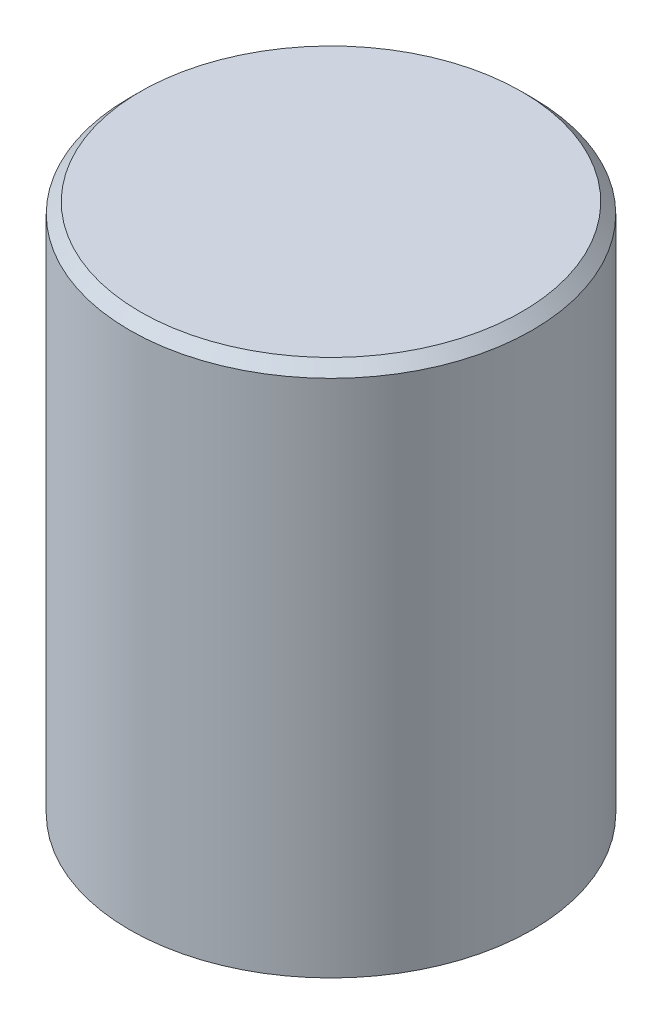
ISO-10303-21;
HEADER;
FILE_DESCRIPTION(('STEP AP214'),'2;1');
FILE_NAME('part.step','',(''),(''),'','','');
FILE_SCHEMA(('AUTOMOTIVE_DESIGN { 1 0 10303 214 1 1 1 1 }'));
ENDSEC;
DATA;
#1=APPLICATION_CONTEXT('core data for automotive mechanical design processes');
#2=APPLICATION_PROTOCOL_DEFINITION('international standard','automotive_design',2000,#1);
#3=PRODUCT_CONTEXT('',#1,'mechanical');
#4=PRODUCT('Part','Part','',(#3));
#5=PRODUCT_RELATED_PRODUCT_CATEGORY('part','',(#4));
#6=PRODUCT_DEFINITION_FORMATION('','',#4);
#7=PRODUCT_DEFINITION_CONTEXT('part definition',#1,'design');
#8=PRODUCT_DEFINITION('design','',#6,#7);
#9=PRODUCT_DEFINITION_SHAPE('','',#8);
#10=(LENGTH_UNIT() NAMED_UNIT(*) SI_UNIT(.MILLI.,.METRE.));
#11=(NAMED_UNIT(*) PLANE_ANGLE_UNIT() SI_UNIT($,.RADIAN.));
#12=(NAMED_UNIT(*) SI_UNIT($,.STERADIAN.) SOLID_ANGLE_UNIT());
#13=UNCERTAINTY_MEASURE_WITH_UNIT(LENGTH_MEASURE(1.E-05),#10,'distance_accuracy_value','');
#14=(GEOMETRIC_REPRESENTATION_CONTEXT(3) GLOBAL_UNCERTAINTY_ASSIGNED_CONTEXT((#13)) GLOBAL_UNIT_ASSIGNED_CONTEXT((#10,
#11,#12)) REPRESENTATION_CONTEXT('',''));
#15=CARTESIAN_POINT('',(0.,0.,0.));
#16=DIRECTION('',(0.,0.,1.));
#17=DIRECTION('',(1.,0.,0.));
#18=AXIS2_PLACEMENT_3D('',#15,#16,#17);
#19=CARTESIAN_POINT('',(0.,0.,0.));
#20=DIRECTION('',(0.,-1.,0.));
#21=DIRECTION('',(0.,0.,-1.));
#22=AXIS2_PLACEMENT_3D('',#19,#20,#21);
#23=CYLINDRICAL_SURFACE('',#22,19.);
#24=CARTESIAN_POINT('',(0.,49.,0.));
#25=DIRECTION('',(0.,-1.,0.));
#26=DIRECTION('',(0.,0.,-1.));
#27=AXIS2_PLACEMENT_3D('',#24,#25,#26);
#28=CIRCLE('',#27,19.);
#29=CARTESIAN_POINT('',(0.,49.,-19.));
#30=VERTEX_POINT('',#29);
#31=EDGE_CURVE('E47',#30,#30,#28,.T.);
#32=ORIENTED_EDGE('',*,*,#31,.T.);
#33=EDGE_LOOP('',(#32));
#34=FACE_BOUND('',#33,.T.);
#35=CARTESIAN_POINT('',(0.,0.,0.));
#36=DIRECTION('',(0.,-1.,0.));
#37=DIRECTION('',(0.,0.,-1.));
#38=AXIS2_PLACEMENT_3D('',#35,#36,#37);
#39=CIRCLE('',#38,19.);
#40=CARTESIAN_POINT('',(0.,0.,-19.));
#41=VERTEX_POINT('',#40);
#42=EDGE_CURVE('E66',#41,#41,#39,.T.);
#43=ORIENTED_EDGE('',*,*,#42,.F.);
#44=EDGE_LOOP('',(#43));
#45=FACE_BOUND('',#44,.T.);
#46=ADVANCED_FACE('F39',(#34,#45),#23,.T.);
#47=CARTESIAN_POINT('',(-19.,50.,0.));
#48=DIRECTION('',(0.,-1.,0.));
#49=DIRECTION('',(0.,0.,-1.));
#50=AXIS2_PLACEMENT_3D('',#47,#48,#49);
#51=PLANE('',#50);
#52=CARTESIAN_POINT('',(0.,50.,0.));
#53=DIRECTION('',(0.,-1.,0.));
#54=DIRECTION('',(0.,0.,-1.));
#55=AXIS2_PLACEMENT_3D('',#52,#53,#54);
#56=CIRCLE('',#55,18.);
#57=CARTESIAN_POINT('',(0.,50.,-18.));
#58=VERTEX_POINT('',#57);
#59=EDGE_CURVE('E10',#58,#58,#56,.F.);
#60=ORIENTED_EDGE('',*,*,#59,.T.);
#61=EDGE_LOOP('',(#60));
#62=FACE_BOUND('',#61,.T.);
#63=ADVANCED_FACE('F73',(#62),#51,.F.);
#64=CARTESIAN_POINT('',(-14.,45.,0.));
#65=DIRECTION('',(0.,1.,0.));
#66=DIRECTION('',(0.,0.,1.));
#67=AXIS2_PLACEMENT_3D('',#64,#65,#66);
#68=PLANE('',#67);
#69=CARTESIAN_POINT('',(0.,45.,0.));
#70=DIRECTION('',(0.,-1.,0.));
#71=DIRECTION('',(0.,0.,-1.));
#72=AXIS2_PLACEMENT_3D('',#69,#70,#71);
#73=CIRCLE('',#72,14.);
#74=CARTESIAN_POINT('',(0.,45.,-14.));
#75=VERTEX_POINT('',#74);
#76=EDGE_CURVE('E51',#75,#75,#73,.T.);
#77=ORIENTED_EDGE('',*,*,#76,.T.);
#78=EDGE_LOOP('',(#77));
#79=FACE_BOUND('',#78,.T.);
#80=ADVANCED_FACE('F78',(#79),#68,.F.);
#81=CARTESIAN_POINT('',(0.,0.,0.));
#82=DIRECTION('',(0.,-1.,0.));
#83=DIRECTION('',(0.,0.,-1.));
#84=AXIS2_PLACEMENT_3D('',#81,#82,#83);
#85=CYLINDRICAL_SURFACE('',#84,14.);
#86=ORIENTED_EDGE('',*,*,#76,.F.);
#87=EDGE_LOOP('',(#86));
#88=FACE_BOUND('',#87,.T.);
#89=CARTESIAN_POINT('',(0.,2.,0.));
#90=DIRECTION('',(0.,-1.,0.));
#91=DIRECTION('',(0.,0.,-1.));
#92=AXIS2_PLACEMENT_3D('',#89,#90,#91);
#93=CIRCLE('',#92,14.);
#94=CARTESIAN_POINT('',(0.,2.,-14.));
#95=VERTEX_POINT('',#94);
#96=EDGE_CURVE('E55',#95,#95,#93,.T.);
#97=ORIENTED_EDGE('',*,*,#96,.T.);
#98=EDGE_LOOP('',(#97));
#99=FACE_BOUND('',#98,.T.);
#100=ADVANCED_FACE('F83',(#88,#99),#85,.F.);
#101=CARTESIAN_POINT('',(-17.,2.,0.));
#102=DIRECTION('',(0.,1.,0.));
#103=DIRECTION('',(0.,0.,1.));
#104=AXIS2_PLACEMENT_3D('',#101,#102,#103);
#105=PLANE('',#104);
#106=ORIENTED_EDGE('',*,*,#96,.F.);
#107=EDGE_LOOP('',(#106));
#108=FACE_BOUND('',#107,.T.);
#109=CARTESIAN_POINT('',(0.,2.,0.));
#110=DIRECTION('',(0.,-1.,0.));
#111=DIRECTION('',(0.,0.,-1.));
#112=AXIS2_PLACEMENT_3D('',#109,#110,#111);
#113=CIRCLE('',#112,17.);
#114=CARTESIAN_POINT('',(0.,2.,-17.));
#115=VERTEX_POINT('',#114);
#116=EDGE_CURVE('E60',#115,#115,#113,.T.);
#117=ORIENTED_EDGE('',*,*,#116,.T.);
#118=EDGE_LOOP('',(#117));
#119=FACE_BOUND('',#118,.T.);
#120=ADVANCED_FACE('F87',(#108,#119),#105,.F.);
#121=CARTESIAN_POINT('',(0.,0.,0.));
#122=DIRECTION('',(0.,-1.,0.));
#123=DIRECTION('',(0.,0.,-1.));
#124=AXIS2_PLACEMENT_3D('',#121,#122,#123);
#125=CYLINDRICAL_SURFACE('',#124,17.);
#126=ORIENTED_EDGE('',*,*,#116,.F.);
#127=EDGE_LOOP('',(#126));
#128=FACE_BOUND('',#127,.T.);
#129=CARTESIAN_POINT('',(0.,0.,0.));
#130=DIRECTION('',(0.,-1.,0.));
#131=DIRECTION('',(0.,0.,-1.));
#132=AXIS2_PLACEMENT_3D('',#129,#130,#131);
#133=CIRCLE('',#132,17.);
#134=CARTESIAN_POINT('',(0.,0.,-17.));
#135=VERTEX_POINT('',#134);
#136=EDGE_CURVE('E63',#135,#135,#133,.T.);
#137=ORIENTED_EDGE('',*,*,#136,.T.);
#138=EDGE_LOOP('',(#137));
#139=FACE_BOUND('',#138,.T.);
#140=ADVANCED_FACE('F91',(#128,#139),#125,.F.);
#141=CARTESIAN_POINT('',(-19.,0.,0.));
#142=DIRECTION('',(0.,1.,0.));
#143=DIRECTION('',(0.,0.,1.));
#144=AXIS2_PLACEMENT_3D('',#141,#142,#143);
#145=PLANE('',#144);
#146=ORIENTED_EDGE('',*,*,#136,.F.);
#147=EDGE_LOOP('',(#146));
#148=FACE_BOUND('',#147,.T.);
#149=ORIENTED_EDGE('',*,*,#42,.T.);
#150=EDGE_LOOP('',(#149));
#151=FACE_BOUND('',#150,.T.);
#152=ADVANCED_FACE('F70',(#148,#151),#145,.F.);
#153=CARTESIAN_POINT('',(0.,49.,0.));
#154=DIRECTION('',(0.,-1.,0.));
#155=DIRECTION('',(0.,0.,-1.));
#156=AXIS2_PLACEMENT_3D('',#153,#154,#155);
#157=CONICAL_SURFACE('',#156,19.,0.78539816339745);
#158=ORIENTED_EDGE('',*,*,#59,.F.);
#159=EDGE_LOOP('',(#158));
#160=FACE_BOUND('',#159,.T.);
#161=ORIENTED_EDGE('',*,*,#31,.F.);
#162=EDGE_LOOP('',(#161));
#163=FACE_BOUND('',#162,.T.);
#164=ADVANCED_FACE('F42',(#160,#163),#157,.T.);
#165=CLOSED_SHELL('',(#46,#63,#80,#100,#120,#140,#152,#164));
#166=MANIFOLD_SOLID_BREP('B2',#165);
#167=ADVANCED_BREP_SHAPE_REPRESENTATION('',(#18,#166),#14);
#168=SHAPE_DEFINITION_REPRESENTATION(#9,#167);
ENDSEC;
END-ISO-10303-21;
